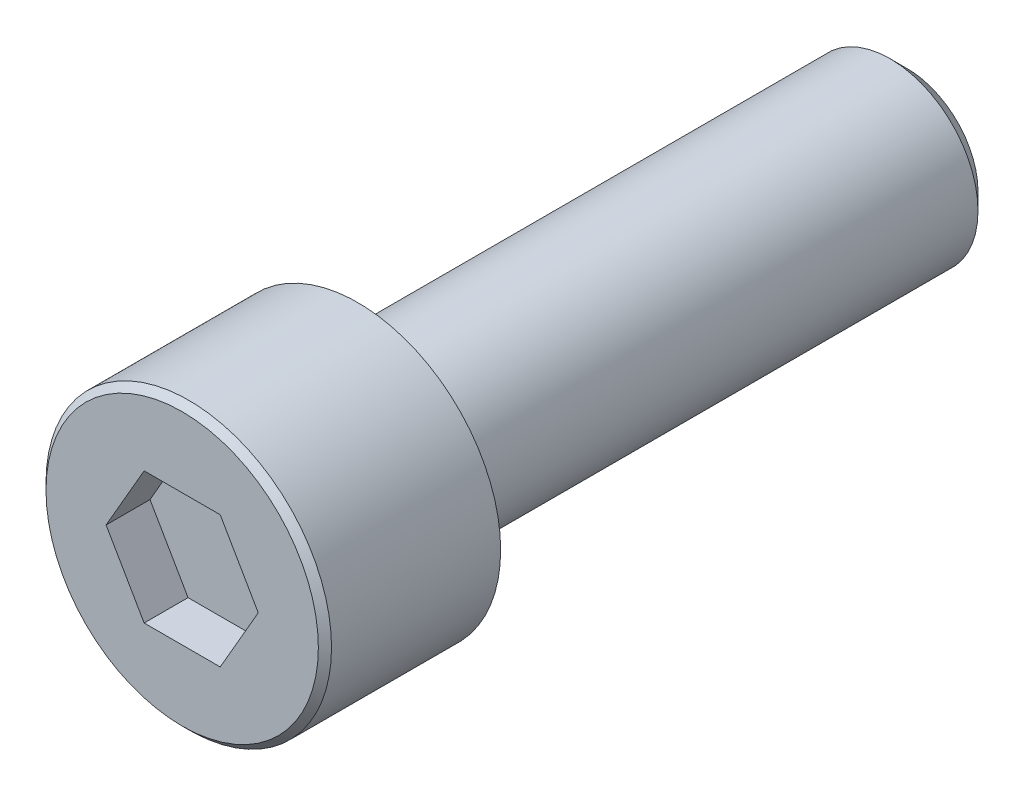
ISO-10303-21;
HEADER;
FILE_DESCRIPTION(('STEP AP214'),'2;1');
FILE_NAME('part.step','',(''),(''),'','','');
FILE_SCHEMA(('AUTOMOTIVE_DESIGN { 1 0 10303 214 1 1 1 1 }'));
ENDSEC;
DATA;
#1=APPLICATION_CONTEXT('core data for automotive mechanical design processes');
#2=APPLICATION_PROTOCOL_DEFINITION('international standard','automotive_design',2000,#1);
#3=PRODUCT_CONTEXT('',#1,'mechanical');
#4=PRODUCT('Part','Part','',(#3));
#5=PRODUCT_RELATED_PRODUCT_CATEGORY('part','',(#4));
#6=PRODUCT_DEFINITION_FORMATION('','',#4);
#7=PRODUCT_DEFINITION_CONTEXT('part definition',#1,'design');
#8=PRODUCT_DEFINITION('design','',#6,#7);
#9=PRODUCT_DEFINITION_SHAPE('','',#8);
#10=(LENGTH_UNIT() NAMED_UNIT(*) SI_UNIT(.MILLI.,.METRE.));
#11=(NAMED_UNIT(*) PLANE_ANGLE_UNIT() SI_UNIT($,.RADIAN.));
#12=(NAMED_UNIT(*) SI_UNIT($,.STERADIAN.) SOLID_ANGLE_UNIT());
#13=UNCERTAINTY_MEASURE_WITH_UNIT(LENGTH_MEASURE(1.E-05),#10,'distance_accuracy_value','');
#14=(GEOMETRIC_REPRESENTATION_CONTEXT(3) GLOBAL_UNCERTAINTY_ASSIGNED_CONTEXT((#13)) GLOBAL_UNIT_ASSIGNED_CONTEXT((#10,
#11,#12)) REPRESENTATION_CONTEXT('',''));
#15=CARTESIAN_POINT('',(0.,0.,0.));
#16=DIRECTION('',(0.,0.,1.));
#17=DIRECTION('',(1.,0.,0.));
#18=AXIS2_PLACEMENT_3D('',#15,#16,#17);
#19=CARTESIAN_POINT('',(0.,0.,8.));
#20=DIRECTION('',(0.,0.,-1.));
#21=DIRECTION('',(-1.,0.,0.));
#22=AXIS2_PLACEMENT_3D('',#19,#20,#21);
#23=PLANE('',#22);
#24=DIRECTION('',(1.,0.,0.));
#25=VECTOR('',#24,1.);
#26=CARTESIAN_POINT('',(-1.73205080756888,-3.,8.));
#27=LINE('',#26,#25);
#28=CARTESIAN_POINT('',(-1.73205080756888,-3.,8.));
#29=VERTEX_POINT('',#28);
#30=CARTESIAN_POINT('',(1.73205080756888,-3.,8.));
#31=VERTEX_POINT('',#30);
#32=EDGE_CURVE('E104',#29,#31,#27,.T.);
#33=ORIENTED_EDGE('',*,*,#32,.F.);
#34=DIRECTION('',(0.5,-0.866025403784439,0.));
#35=VECTOR('',#34,1.);
#36=CARTESIAN_POINT('',(-3.46410161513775,0.,8.));
#37=LINE('',#36,#35);
#38=CARTESIAN_POINT('',(-3.46410161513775,0.,8.));
#39=VERTEX_POINT('',#38);
#40=EDGE_CURVE('E30',#39,#29,#37,.T.);
#41=ORIENTED_EDGE('',*,*,#40,.F.);
#42=DIRECTION('',(-0.5,-0.866025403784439,0.));
#43=VECTOR('',#42,1.);
#44=CARTESIAN_POINT('',(-1.73205080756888,3.,8.));
#45=LINE('',#44,#43);
#46=CARTESIAN_POINT('',(-1.73205080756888,3.,8.));
#47=VERTEX_POINT('',#46);
#48=EDGE_CURVE('E113',#47,#39,#45,.T.);
#49=ORIENTED_EDGE('',*,*,#48,.F.);
#50=DIRECTION('',(-1.,0.,0.));
#51=VECTOR('',#50,1.);
#52=CARTESIAN_POINT('',(1.73205080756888,3.,8.));
#53=LINE('',#52,#51);
#54=CARTESIAN_POINT('',(1.73205080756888,3.,8.));
#55=VERTEX_POINT('',#54);
#56=EDGE_CURVE('E111',#55,#47,#53,.T.);
#57=ORIENTED_EDGE('',*,*,#56,.F.);
#58=DIRECTION('',(-0.5,0.866025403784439,0.));
#59=VECTOR('',#58,1.);
#60=CARTESIAN_POINT('',(3.46410161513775,0.,8.));
#61=LINE('',#60,#59);
#62=CARTESIAN_POINT('',(3.46410161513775,0.,8.));
#63=VERTEX_POINT('',#62);
#64=EDGE_CURVE('E78',#63,#55,#61,.T.);
#65=ORIENTED_EDGE('',*,*,#64,.F.);
#66=DIRECTION('',(0.5,0.866025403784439,0.));
#67=VECTOR('',#66,1.);
#68=CARTESIAN_POINT('',(1.73205080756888,-3.,8.));
#69=LINE('',#68,#67);
#70=EDGE_CURVE('E107',#31,#63,#69,.T.);
#71=ORIENTED_EDGE('',*,*,#70,.F.);
#72=EDGE_LOOP('',(#33,#41,#49,#57,#65,#71));
#73=FACE_BOUND('',#72,.T.);
#74=CARTESIAN_POINT('',(0.,0.,8.));
#75=DIRECTION('',(0.,0.,1.));
#76=DIRECTION('',(1.,0.,0.));
#77=AXIS2_PLACEMENT_3D('',#74,#75,#76);
#78=CIRCLE('',#77,6.2);
#79=CARTESIAN_POINT('',(6.2,0.,8.));
#80=VERTEX_POINT('',#79);
#81=EDGE_CURVE('E11',#80,#80,#78,.T.);
#82=ORIENTED_EDGE('',*,*,#81,.T.);
#83=EDGE_LOOP('',(#82));
#84=FACE_BOUND('',#83,.T.);
#85=ADVANCED_FACE('F16',(#73,#84),#23,.F.);
#86=CARTESIAN_POINT('',(0.,0.,7.7));
#87=DIRECTION('',(0.,0.,-1.));
#88=DIRECTION('',(-1.,0.,0.));
#89=AXIS2_PLACEMENT_3D('',#86,#87,#88);
#90=CONICAL_SURFACE('',#89,6.5,0.785398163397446);
#91=ORIENTED_EDGE('',*,*,#81,.F.);
#92=EDGE_LOOP('',(#91));
#93=FACE_BOUND('',#92,.T.);
#94=CARTESIAN_POINT('',(0.,0.,7.7));
#95=DIRECTION('',(0.,0.,1.));
#96=DIRECTION('',(1.,0.,0.));
#97=AXIS2_PLACEMENT_3D('',#94,#95,#96);
#98=CIRCLE('',#97,6.5);
#99=CARTESIAN_POINT('',(6.5,0.,7.7));
#100=VERTEX_POINT('',#99);
#101=EDGE_CURVE('E23',#100,#100,#98,.T.);
#102=ORIENTED_EDGE('',*,*,#101,.T.);
#103=EDGE_LOOP('',(#102));
#104=FACE_BOUND('',#103,.T.);
#105=ADVANCED_FACE('F136',(#93,#104),#90,.T.);
#106=CARTESIAN_POINT('',(0.,0.,-25.));
#107=DIRECTION('',(0.,0.,1.));
#108=DIRECTION('',(1.,0.,0.));
#109=AXIS2_PLACEMENT_3D('',#106,#107,#108);
#110=CYLINDRICAL_SURFACE('',#109,6.5);
#111=ORIENTED_EDGE('',*,*,#101,.F.);
#112=EDGE_LOOP('',(#111));
#113=FACE_BOUND('',#112,.T.);
#114=CARTESIAN_POINT('',(0.,0.,0.));
#115=DIRECTION('',(0.,0.,1.));
#116=DIRECTION('',(1.,0.,0.));
#117=AXIS2_PLACEMENT_3D('',#114,#115,#116);
#118=CIRCLE('',#117,6.5);
#119=CARTESIAN_POINT('',(6.5,0.,0.));
#120=VERTEX_POINT('',#119);
#121=EDGE_CURVE('E131',#120,#120,#118,.T.);
#122=ORIENTED_EDGE('',*,*,#121,.T.);
#123=EDGE_LOOP('',(#122));
#124=FACE_BOUND('',#123,.T.);
#125=ADVANCED_FACE('F138',(#113,#124),#110,.T.);
#126=CARTESIAN_POINT('',(0.,6.5,0.));
#127=DIRECTION('',(0.,0.,1.));
#128=DIRECTION('',(1.,0.,0.));
#129=AXIS2_PLACEMENT_3D('',#126,#127,#128);
#130=PLANE('',#129);
#131=ORIENTED_EDGE('',*,*,#121,.F.);
#132=EDGE_LOOP('',(#131));
#133=FACE_BOUND('',#132,.T.);
#134=CARTESIAN_POINT('',(0.,0.,0.));
#135=DIRECTION('',(0.,0.,1.));
#136=DIRECTION('',(1.,0.,0.));
#137=AXIS2_PLACEMENT_3D('',#134,#135,#136);
#138=CIRCLE('',#137,4.);
#139=CARTESIAN_POINT('',(4.,0.,0.));
#140=VERTEX_POINT('',#139);
#141=EDGE_CURVE('E128',#140,#140,#138,.T.);
#142=ORIENTED_EDGE('',*,*,#141,.T.);
#143=EDGE_LOOP('',(#142));
#144=FACE_BOUND('',#143,.T.);
#145=ADVANCED_FACE('F141',(#133,#144),#130,.F.);
#146=CARTESIAN_POINT('',(0.,0.,-25.));
#147=DIRECTION('',(0.,0.,1.));
#148=DIRECTION('',(1.,0.,0.));
#149=AXIS2_PLACEMENT_3D('',#146,#147,#148);
#150=CYLINDRICAL_SURFACE('',#149,4.);
#151=ORIENTED_EDGE('',*,*,#141,.F.);
#152=EDGE_LOOP('',(#151));
#153=FACE_BOUND('',#152,.T.);
#154=CARTESIAN_POINT('',(0.,0.,-24.233));
#155=DIRECTION('',(0.,0.,1.));
#156=DIRECTION('',(1.,0.,0.));
#157=AXIS2_PLACEMENT_3D('',#154,#155,#156);
#158=CIRCLE('',#157,4.);
#159=CARTESIAN_POINT('',(4.,0.,-24.233));
#160=VERTEX_POINT('',#159);
#161=EDGE_CURVE('E125',#160,#160,#158,.T.);
#162=ORIENTED_EDGE('',*,*,#161,.T.);
#163=EDGE_LOOP('',(#162));
#164=FACE_BOUND('',#163,.T.);
#165=ADVANCED_FACE('F147',(#153,#164),#150,.T.);
#166=CARTESIAN_POINT('',(0.,0.,-25.));
#167=DIRECTION('',(0.,0.,1.));
#168=DIRECTION('',(1.,0.,0.));
#169=AXIS2_PLACEMENT_3D('',#166,#167,#168);
#170=CONICAL_SURFACE('',#169,3.233,0.785398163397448);
#171=ORIENTED_EDGE('',*,*,#161,.F.);
#172=EDGE_LOOP('',(#171));
#173=FACE_BOUND('',#172,.T.);
#174=CARTESIAN_POINT('',(0.,0.,-25.));
#175=DIRECTION('',(0.,0.,1.));
#176=DIRECTION('',(1.,0.,0.));
#177=AXIS2_PLACEMENT_3D('',#174,#175,#176);
#178=CIRCLE('',#177,3.233);
#179=CARTESIAN_POINT('',(3.233,0.,-25.));
#180=VERTEX_POINT('',#179);
#181=EDGE_CURVE('E117',#180,#180,#178,.T.);
#182=ORIENTED_EDGE('',*,*,#181,.T.);
#183=EDGE_LOOP('',(#182));
#184=FACE_BOUND('',#183,.T.);
#185=ADVANCED_FACE('F153',(#173,#184),#170,.T.);
#186=CARTESIAN_POINT('',(0.,3.233,-25.));
#187=DIRECTION('',(0.,0.,1.));
#188=DIRECTION('',(1.,0.,0.));
#189=AXIS2_PLACEMENT_3D('',#186,#187,#188);
#190=PLANE('',#189);
#191=ORIENTED_EDGE('',*,*,#181,.F.);
#192=EDGE_LOOP('',(#191));
#193=FACE_BOUND('',#192,.T.);
#194=ADVANCED_FACE('F159',(#193),#190,.F.);
#195=CARTESIAN_POINT('',(-3.46410161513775,0.,6.));
#196=DIRECTION('',(-0.866025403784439,-0.5,0.));
#197=DIRECTION('',(0.5,-0.866025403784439,0.));
#198=AXIS2_PLACEMENT_3D('',#195,#196,#197);
#199=PLANE('',#198);
#200=ORIENTED_EDGE('',*,*,#40,.T.);
#201=DIRECTION('',(0.,0.,1.));
#202=VECTOR('',#201,1.);
#203=CARTESIAN_POINT('',(-1.73205080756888,-3.,6.));
#204=LINE('',#203,#202);
#205=CARTESIAN_POINT('',(-1.73205080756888,-3.,6.));
#206=VERTEX_POINT('',#205);
#207=EDGE_CURVE('E60',#206,#29,#204,.T.);
#208=ORIENTED_EDGE('',*,*,#207,.F.);
#209=DIRECTION('',(0.5,-0.866025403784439,0.));
#210=VECTOR('',#209,1.);
#211=CARTESIAN_POINT('',(-3.46410161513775,0.,6.));
#212=LINE('',#211,#210);
#213=CARTESIAN_POINT('',(-3.46410161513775,0.,6.));
#214=VERTEX_POINT('',#213);
#215=EDGE_CURVE('E115',#214,#206,#212,.T.);
#216=ORIENTED_EDGE('',*,*,#215,.F.);
#217=DIRECTION('',(0.,0.,1.));
#218=VECTOR('',#217,1.);
#219=CARTESIAN_POINT('',(-3.46410161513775,0.,6.));
#220=LINE('',#219,#218);
#221=EDGE_CURVE('E38',#214,#39,#220,.T.);
#222=ORIENTED_EDGE('',*,*,#221,.T.);
#223=EDGE_LOOP('',(#200,#208,#216,#222));
#224=FACE_BOUND('',#223,.T.);
#225=ADVANCED_FACE('F164',(#224),#199,.F.);
#226=CARTESIAN_POINT('',(-1.73205080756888,3.,6.));
#227=DIRECTION('',(-0.866025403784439,0.5,0.));
#228=DIRECTION('',(-0.5,-0.866025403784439,0.));
#229=AXIS2_PLACEMENT_3D('',#226,#227,#228);
#230=PLANE('',#229);
#231=ORIENTED_EDGE('',*,*,#48,.T.);
#232=ORIENTED_EDGE('',*,*,#221,.F.);
#233=DIRECTION('',(-0.5,-0.866025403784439,0.));
#234=VECTOR('',#233,1.);
#235=CARTESIAN_POINT('',(-1.73205080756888,3.,6.));
#236=LINE('',#235,#234);
#237=CARTESIAN_POINT('',(-1.73205080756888,3.,6.));
#238=VERTEX_POINT('',#237);
#239=EDGE_CURVE('E90',#238,#214,#236,.T.);
#240=ORIENTED_EDGE('',*,*,#239,.F.);
#241=DIRECTION('',(0.,0.,1.));
#242=VECTOR('',#241,1.);
#243=CARTESIAN_POINT('',(-1.73205080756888,3.,6.));
#244=LINE('',#243,#242);
#245=EDGE_CURVE('E82',#238,#47,#244,.T.);
#246=ORIENTED_EDGE('',*,*,#245,.T.);
#247=EDGE_LOOP('',(#231,#232,#240,#246));
#248=FACE_BOUND('',#247,.T.);
#249=ADVANCED_FACE('F171',(#248),#230,.F.);
#250=CARTESIAN_POINT('',(1.73205080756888,3.,6.));
#251=DIRECTION('',(0.,1.,0.));
#252=DIRECTION('',(0.,0.,1.));
#253=AXIS2_PLACEMENT_3D('',#250,#251,#252);
#254=PLANE('',#253);
#255=ORIENTED_EDGE('',*,*,#56,.T.);
#256=ORIENTED_EDGE('',*,*,#245,.F.);
#257=DIRECTION('',(-1.,0.,0.));
#258=VECTOR('',#257,1.);
#259=CARTESIAN_POINT('',(1.73205080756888,3.,6.));
#260=LINE('',#259,#258);
#261=CARTESIAN_POINT('',(1.73205080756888,3.,6.));
#262=VERTEX_POINT('',#261);
#263=EDGE_CURVE('E86',#262,#238,#260,.T.);
#264=ORIENTED_EDGE('',*,*,#263,.F.);
#265=DIRECTION('',(0.,0.,1.));
#266=VECTOR('',#265,1.);
#267=CARTESIAN_POINT('',(1.73205080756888,3.,6.));
#268=LINE('',#267,#266);
#269=EDGE_CURVE('E71',#262,#55,#268,.T.);
#270=ORIENTED_EDGE('',*,*,#269,.T.);
#271=EDGE_LOOP('',(#255,#256,#264,#270));
#272=FACE_BOUND('',#271,.T.);
#273=ADVANCED_FACE('F87',(#272),#254,.F.);
#274=CARTESIAN_POINT('',(3.46410161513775,0.,6.));
#275=DIRECTION('',(0.866025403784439,0.5,0.));
#276=DIRECTION('',(-0.5,0.866025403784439,0.));
#277=AXIS2_PLACEMENT_3D('',#274,#275,#276);
#278=PLANE('',#277);
#279=ORIENTED_EDGE('',*,*,#64,.T.);
#280=ORIENTED_EDGE('',*,*,#269,.F.);
#281=DIRECTION('',(-0.5,0.866025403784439,0.));
#282=VECTOR('',#281,1.);
#283=CARTESIAN_POINT('',(3.46410161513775,0.,6.));
#284=LINE('',#283,#282);
#285=CARTESIAN_POINT('',(3.46410161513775,0.,6.));
#286=VERTEX_POINT('',#285);
#287=EDGE_CURVE('E75',#286,#262,#284,.T.);
#288=ORIENTED_EDGE('',*,*,#287,.F.);
#289=DIRECTION('',(0.,0.,1.));
#290=VECTOR('',#289,1.);
#291=CARTESIAN_POINT('',(3.46410161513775,0.,6.));
#292=LINE('',#291,#290);
#293=EDGE_CURVE('E83',#286,#63,#292,.T.);
#294=ORIENTED_EDGE('',*,*,#293,.T.);
#295=EDGE_LOOP('',(#279,#280,#288,#294));
#296=FACE_BOUND('',#295,.T.);
#297=ADVANCED_FACE('F73',(#296),#278,.F.);
#298=CARTESIAN_POINT('',(1.73205080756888,-3.,6.));
#299=DIRECTION('',(0.866025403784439,-0.5,0.));
#300=DIRECTION('',(0.5,0.866025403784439,0.));
#301=AXIS2_PLACEMENT_3D('',#298,#299,#300);
#302=PLANE('',#301);
#303=ORIENTED_EDGE('',*,*,#70,.T.);
#304=ORIENTED_EDGE('',*,*,#293,.F.);
#305=DIRECTION('',(0.5,0.866025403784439,0.));
#306=VECTOR('',#305,1.);
#307=CARTESIAN_POINT('',(1.73205080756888,-3.,6.));
#308=LINE('',#307,#306);
#309=CARTESIAN_POINT('',(1.73205080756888,-3.,6.));
#310=VERTEX_POINT('',#309);
#311=EDGE_CURVE('E96',#310,#286,#308,.T.);
#312=ORIENTED_EDGE('',*,*,#311,.F.);
#313=DIRECTION('',(0.,0.,1.));
#314=VECTOR('',#313,1.);
#315=CARTESIAN_POINT('',(1.73205080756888,-3.,6.));
#316=LINE('',#315,#314);
#317=EDGE_CURVE('E120',#310,#31,#316,.T.);
#318=ORIENTED_EDGE('',*,*,#317,.T.);
#319=EDGE_LOOP('',(#303,#304,#312,#318));
#320=FACE_BOUND('',#319,.T.);
#321=ADVANCED_FACE('F199',(#320),#302,.F.);
#322=CARTESIAN_POINT('',(-1.73205080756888,-3.,6.));
#323=DIRECTION('',(0.,-1.,0.));
#324=DIRECTION('',(0.,0.,-1.));
#325=AXIS2_PLACEMENT_3D('',#322,#323,#324);
#326=PLANE('',#325);
#327=ORIENTED_EDGE('',*,*,#32,.T.);
#328=ORIENTED_EDGE('',*,*,#317,.F.);
#329=DIRECTION('',(1.,0.,0.));
#330=VECTOR('',#329,1.);
#331=CARTESIAN_POINT('',(-1.73205080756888,-3.,6.));
#332=LINE('',#331,#330);
#333=EDGE_CURVE('E98',#206,#310,#332,.T.);
#334=ORIENTED_EDGE('',*,*,#333,.F.);
#335=ORIENTED_EDGE('',*,*,#207,.T.);
#336=EDGE_LOOP('',(#327,#328,#334,#335));
#337=FACE_BOUND('',#336,.T.);
#338=ADVANCED_FACE('F186',(#337),#326,.F.);
#339=CARTESIAN_POINT('',(0.,0.,6.));
#340=DIRECTION('',(0.,0.,1.));
#341=DIRECTION('',(1.,0.,0.));
#342=AXIS2_PLACEMENT_3D('',#339,#340,#341);
#343=PLANE('',#342);
#344=ORIENTED_EDGE('',*,*,#215,.T.);
#345=ORIENTED_EDGE('',*,*,#333,.T.);
#346=ORIENTED_EDGE('',*,*,#311,.T.);
#347=ORIENTED_EDGE('',*,*,#287,.T.);
#348=ORIENTED_EDGE('',*,*,#263,.T.);
#349=ORIENTED_EDGE('',*,*,#239,.T.);
#350=EDGE_LOOP('',(#344,#345,#346,#347,#348,#349));
#351=FACE_BOUND('',#350,.T.);
#352=ADVANCED_FACE('F93',(#351),#343,.T.);
#353=CLOSED_SHELL('',(#85,#105,#125,#145,#165,#185,#194,#225,#249,#273,#297,#321,#338,#352));
#354=MANIFOLD_SOLID_BREP('B1',#353);
#355=ADVANCED_BREP_SHAPE_REPRESENTATION('',(#18,#354),#14);
#356=SHAPE_DEFINITION_REPRESENTATION(#9,#355);
ENDSEC;
END-ISO-10303-21;
